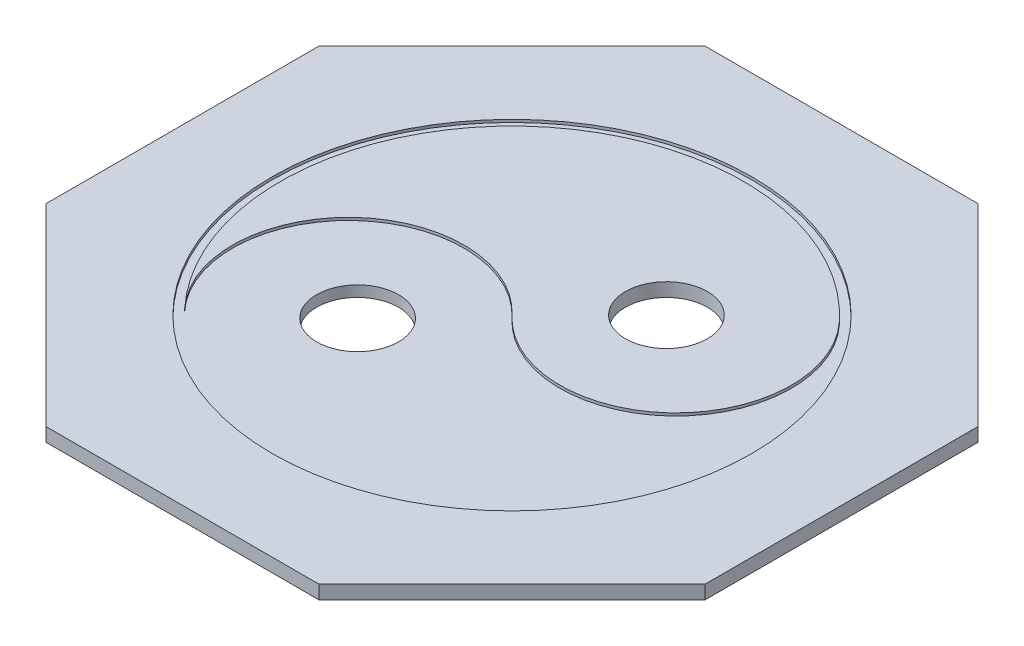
ISO-10303-21;
HEADER;
FILE_DESCRIPTION(('STEP AP214'),'2;1');
FILE_NAME('part.step','',(''),(''),'','','');
FILE_SCHEMA(('AUTOMOTIVE_DESIGN { 1 0 10303 214 1 1 1 1 }'));
ENDSEC;
DATA;
#1=APPLICATION_CONTEXT('core data for automotive mechanical design processes');
#2=APPLICATION_PROTOCOL_DEFINITION('international standard','automotive_design',2000,#1);
#3=PRODUCT_CONTEXT('',#1,'mechanical');
#4=PRODUCT('Part','Part','',(#3));
#5=PRODUCT_RELATED_PRODUCT_CATEGORY('part','',(#4));
#6=PRODUCT_DEFINITION_FORMATION('','',#4);
#7=PRODUCT_DEFINITION_CONTEXT('part definition',#1,'design');
#8=PRODUCT_DEFINITION('design','',#6,#7);
#9=PRODUCT_DEFINITION_SHAPE('','',#8);
#10=(LENGTH_UNIT() NAMED_UNIT(*) SI_UNIT(.MILLI.,.METRE.));
#11=(NAMED_UNIT(*) PLANE_ANGLE_UNIT() SI_UNIT($,.RADIAN.));
#12=(NAMED_UNIT(*) SI_UNIT($,.STERADIAN.) SOLID_ANGLE_UNIT());
#13=UNCERTAINTY_MEASURE_WITH_UNIT(LENGTH_MEASURE(1.E-05),#10,'distance_accuracy_value','');
#14=(GEOMETRIC_REPRESENTATION_CONTEXT(3) GLOBAL_UNCERTAINTY_ASSIGNED_CONTEXT((#13)) GLOBAL_UNIT_ASSIGNED_CONTEXT((#10,
#11,#12)) REPRESENTATION_CONTEXT('',''));
#15=CARTESIAN_POINT('',(0.,0.,0.));
#16=DIRECTION('',(0.,0.,1.));
#17=DIRECTION('',(1.,0.,0.));
#18=AXIS2_PLACEMENT_3D('',#15,#16,#17);
#19=CARTESIAN_POINT('',(0.,5.,0.));
#20=DIRECTION('',(0.,1.,0.));
#21=DIRECTION('',(0.,0.,1.));
#22=AXIS2_PLACEMENT_3D('',#19,#20,#21);
#23=PLANE('',#22);
#24=CARTESIAN_POINT('',(79.8894141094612,5.,-64.61542800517));
#25=DIRECTION('',(0.,1.,0.));
#26=DIRECTION('',(0.,0.,-1.));
#27=AXIS2_PLACEMENT_3D('',#24,#25,#26);
#28=CIRCLE('',#27,15.);
#29=CARTESIAN_POINT('',(79.8894141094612,5.,-79.61542800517));
#30=VERTEX_POINT('',#29);
#31=EDGE_CURVE('E193',#30,#30,#28,.T.);
#32=ORIENTED_EDGE('',*,*,#31,.F.);
#33=EDGE_LOOP('',(#32));
#34=FACE_BOUND('',#33,.T.);
#35=CARTESIAN_POINT('',(20.5913084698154,5.,-7.38349896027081));
#36=DIRECTION('',(0.,1.,0.));
#37=DIRECTION('',(0.,0.,1.));
#38=AXIS2_PLACEMENT_3D('',#35,#36,#37);
#39=CIRCLE('',#38,42.4243422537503);
#40=CARTESIAN_POINT('',(51.6051428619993,5.,-36.3311567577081));
#41=VERTEX_POINT('',#40);
#42=CARTESIAN_POINT('',(-10.4225259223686,5.,21.5641588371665));
#43=VERTEX_POINT('',#42);
#44=EDGE_CURVE('E214',#41,#43,#39,.T.);
#45=ORIENTED_EDGE('',*,*,#44,.F.);
#46=CARTESIAN_POINT('',(82.6189772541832,5.,-65.2788145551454));
#47=DIRECTION('',(0.,1.,0.));
#48=DIRECTION('',(0.,0.,1.));
#49=AXIS2_PLACEMENT_3D('',#46,#47,#48);
#50=CIRCLE('',#49,42.4243422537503);
#51=CARTESIAN_POINT('',(113.632811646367,5.,-94.2264723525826));
#52=VERTEX_POINT('',#51);
#53=EDGE_CURVE('E47',#41,#52,#50,.T.);
#54=ORIENTED_EDGE('',*,*,#53,.T.);
#55=CARTESIAN_POINT('',(51.6051428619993,5.,-36.3311567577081));
#56=DIRECTION('',(0.,1.,0.));
#57=DIRECTION('',(0.,0.,1.));
#58=AXIS2_PLACEMENT_3D('',#55,#56,#57);
#59=CIRCLE('',#58,84.8486845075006);
#60=EDGE_CURVE('E211',#52,#43,#59,.T.);
#61=ORIENTED_EDGE('',*,*,#60,.T.);
#62=EDGE_LOOP('',(#45,#54,#61));
#63=FACE_BOUND('',#62,.T.);
#64=ADVANCED_FACE('F32',(#34,#63),#23,.T.);
#65=CARTESIAN_POINT('',(23.3208716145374,5.,-8.04688551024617));
#66=DIRECTION('',(0.,-1.,0.));
#67=DIRECTION('',(0.,0.,-1.));
#68=AXIS2_PLACEMENT_3D('',#65,#66,#67);
#69=CYLINDRICAL_SURFACE('',#68,15.);
#70=CARTESIAN_POINT('',(23.3208716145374,0.,-8.04688551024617));
#71=DIRECTION('',(0.,1.,0.));
#72=DIRECTION('',(0.,0.,1.));
#73=AXIS2_PLACEMENT_3D('',#70,#71,#72);
#74=CIRCLE('',#73,15.);
#75=CARTESIAN_POINT('',(23.3208716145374,0.,6.95311448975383));
#76=VERTEX_POINT('',#75);
#77=EDGE_CURVE('E145',#76,#76,#74,.T.);
#78=ORIENTED_EDGE('',*,*,#77,.F.);
#79=EDGE_LOOP('',(#78));
#80=FACE_BOUND('',#79,.T.);
#81=CARTESIAN_POINT('',(23.3208716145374,4.,-8.04688551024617));
#82=DIRECTION('',(0.,1.,0.));
#83=DIRECTION('',(0.,0.,1.));
#84=AXIS2_PLACEMENT_3D('',#81,#82,#83);
#85=CIRCLE('',#84,15.);
#86=CARTESIAN_POINT('',(23.3208716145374,4.,6.95311448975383));
#87=VERTEX_POINT('',#86);
#88=EDGE_CURVE('E220',#87,#87,#85,.F.);
#89=ORIENTED_EDGE('',*,*,#88,.F.);
#90=EDGE_LOOP('',(#89));
#91=FACE_BOUND('',#90,.T.);
#92=ADVANCED_FACE('F265',(#80,#91),#69,.F.);
#93=CARTESIAN_POINT('',(51.6051428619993,5.,-36.3311567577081));
#94=DIRECTION('',(0.,1.,0.));
#95=DIRECTION('',(0.,0.,1.));
#96=AXIS2_PLACEMENT_3D('',#93,#94,#95);
#97=CIRCLE('',#96,87.8486845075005);
#98=CARTESIAN_POINT('',(51.6051428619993,5.,51.5175277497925));
#99=VERTEX_POINT('',#98);
#100=EDGE_CURVE('E207',#99,#99,#97,.T.);
#101=ORIENTED_EDGE('',*,*,#100,.F.);
#102=EDGE_LOOP('',(#101));
#103=FACE_BOUND('',#102,.T.);
#104=DIRECTION('',(0.707106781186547,0.,0.707106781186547));
#105=VECTOR('',#104,1.);
#106=CARTESIAN_POINT('',(-69.1055352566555,5.,13.6688432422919));
#107=LINE('',#106,#105);
#108=CARTESIAN_POINT('',(-69.1055352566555,5.,13.6688432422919));
#109=VERTEX_POINT('',#108);
#110=CARTESIAN_POINT('',(1.60514286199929,5.,84.3795213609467));
#111=VERTEX_POINT('',#110);
#112=EDGE_CURVE('E157',#109,#111,#107,.T.);
#113=ORIENTED_EDGE('',*,*,#112,.T.);
#114=DIRECTION('',(1.,0.,0.));
#115=VECTOR('',#114,1.);
#116=CARTESIAN_POINT('',(1.60514286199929,5.,84.3795213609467));
#117=LINE('',#116,#115);
#118=CARTESIAN_POINT('',(101.605142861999,5.,84.3795213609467));
#119=VERTEX_POINT('',#118);
#120=EDGE_CURVE('E97',#111,#119,#117,.T.);
#121=ORIENTED_EDGE('',*,*,#120,.T.);
#122=DIRECTION('',(0.707106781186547,0.,-0.707106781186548));
#123=VECTOR('',#122,1.);
#124=CARTESIAN_POINT('',(101.605142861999,5.,84.3795213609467));
#125=LINE('',#124,#123);
#126=CARTESIAN_POINT('',(172.315820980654,5.,13.6688432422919));
#127=VERTEX_POINT('',#126);
#128=EDGE_CURVE('E172',#119,#127,#125,.T.);
#129=ORIENTED_EDGE('',*,*,#128,.T.);
#130=DIRECTION('',(0.,0.,-1.));
#131=VECTOR('',#130,1.);
#132=CARTESIAN_POINT('',(172.315820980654,5.,13.6688432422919));
#133=LINE('',#132,#131);
#134=CARTESIAN_POINT('',(172.315820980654,5.,-86.3311567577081));
#135=VERTEX_POINT('',#134);
#136=EDGE_CURVE('E185',#127,#135,#133,.T.);
#137=ORIENTED_EDGE('',*,*,#136,.T.);
#138=DIRECTION('',(-0.707106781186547,0.,-0.707106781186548));
#139=VECTOR('',#138,1.);
#140=CARTESIAN_POINT('',(172.315820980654,5.,-86.3311567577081));
#141=LINE('',#140,#139);
#142=CARTESIAN_POINT('',(101.605142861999,5.,-157.041834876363));
#143=VERTEX_POINT('',#142);
#144=EDGE_CURVE('E120',#135,#143,#141,.T.);
#145=ORIENTED_EDGE('',*,*,#144,.T.);
#146=DIRECTION('',(-1.,0.,0.));
#147=VECTOR('',#146,1.);
#148=CARTESIAN_POINT('',(101.605142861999,5.,-157.041834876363));
#149=LINE('',#148,#147);
#150=CARTESIAN_POINT('',(1.60514286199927,5.,-157.041834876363));
#151=VERTEX_POINT('',#150);
#152=EDGE_CURVE('E113',#143,#151,#149,.T.);
#153=ORIENTED_EDGE('',*,*,#152,.T.);
#154=DIRECTION('',(-0.707106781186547,0.,0.707106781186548));
#155=VECTOR('',#154,1.);
#156=CARTESIAN_POINT('',(1.60514286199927,5.,-157.041834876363));
#157=LINE('',#156,#155);
#158=CARTESIAN_POINT('',(-69.1055352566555,5.,-86.3311567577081));
#159=VERTEX_POINT('',#158);
#160=EDGE_CURVE('E117',#151,#159,#157,.T.);
#161=ORIENTED_EDGE('',*,*,#160,.T.);
#162=DIRECTION('',(0.,0.,1.));
#163=VECTOR('',#162,1.);
#164=CARTESIAN_POINT('',(-69.1055352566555,5.,-86.3311567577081));
#165=LINE('',#164,#163);
#166=EDGE_CURVE('E56',#159,#109,#165,.T.);
#167=ORIENTED_EDGE('',*,*,#166,.T.);
#168=EDGE_LOOP('',(#113,#121,#129,#137,#145,#153,#161,#167));
#169=FACE_BOUND('',#168,.T.);
#170=ADVANCED_FACE('F115',(#103,#169),#23,.T.);
#171=CARTESIAN_POINT('',(0.,0.,0.));
#172=DIRECTION('',(0.,1.,0.));
#173=DIRECTION('',(0.,0.,1.));
#174=AXIS2_PLACEMENT_3D('',#171,#172,#173);
#175=PLANE('',#174);
#176=DIRECTION('',(0.707106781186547,0.,0.707106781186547));
#177=VECTOR('',#176,1.);
#178=CARTESIAN_POINT('',(-69.1055352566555,0.,13.6688432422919));
#179=LINE('',#178,#177);
#180=CARTESIAN_POINT('',(-69.1055352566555,0.,13.6688432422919));
#181=VERTEX_POINT('',#180);
#182=CARTESIAN_POINT('',(1.60514286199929,0.,84.3795213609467));
#183=VERTEX_POINT('',#182);
#184=EDGE_CURVE('E141',#181,#183,#179,.T.);
#185=ORIENTED_EDGE('',*,*,#184,.F.);
#186=DIRECTION('',(0.,0.,1.));
#187=VECTOR('',#186,1.);
#188=CARTESIAN_POINT('',(-69.1055352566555,0.,-86.3311567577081));
#189=LINE('',#188,#187);
#190=CARTESIAN_POINT('',(-69.1055352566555,0.,-86.3311567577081));
#191=VERTEX_POINT('',#190);
#192=EDGE_CURVE('E89',#191,#181,#189,.T.);
#193=ORIENTED_EDGE('',*,*,#192,.F.);
#194=DIRECTION('',(-0.707106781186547,0.,0.707106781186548));
#195=VECTOR('',#194,1.);
#196=CARTESIAN_POINT('',(1.60514286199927,0.,-157.041834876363));
#197=LINE('',#196,#195);
#198=CARTESIAN_POINT('',(1.60514286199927,0.,-157.041834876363));
#199=VERTEX_POINT('',#198);
#200=EDGE_CURVE('E154',#199,#191,#197,.T.);
#201=ORIENTED_EDGE('',*,*,#200,.F.);
#202=DIRECTION('',(-1.,0.,0.));
#203=VECTOR('',#202,1.);
#204=CARTESIAN_POINT('',(101.605142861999,0.,-157.041834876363));
#205=LINE('',#204,#203);
#206=CARTESIAN_POINT('',(101.605142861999,0.,-157.041834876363));
#207=VERTEX_POINT('',#206);
#208=EDGE_CURVE('E129',#207,#199,#205,.T.);
#209=ORIENTED_EDGE('',*,*,#208,.F.);
#210=DIRECTION('',(-0.707106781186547,0.,-0.707106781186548));
#211=VECTOR('',#210,1.);
#212=CARTESIAN_POINT('',(172.315820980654,0.,-86.3311567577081));
#213=LINE('',#212,#211);
#214=CARTESIAN_POINT('',(172.315820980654,0.,-86.3311567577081));
#215=VERTEX_POINT('',#214);
#216=EDGE_CURVE('E151',#215,#207,#213,.T.);
#217=ORIENTED_EDGE('',*,*,#216,.F.);
#218=DIRECTION('',(0.,0.,-1.));
#219=VECTOR('',#218,1.);
#220=CARTESIAN_POINT('',(172.315820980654,0.,13.6688432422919));
#221=LINE('',#220,#219);
#222=CARTESIAN_POINT('',(172.315820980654,0.,13.6688432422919));
#223=VERTEX_POINT('',#222);
#224=EDGE_CURVE('E149',#223,#215,#221,.T.);
#225=ORIENTED_EDGE('',*,*,#224,.F.);
#226=DIRECTION('',(0.707106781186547,0.,-0.707106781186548));
#227=VECTOR('',#226,1.);
#228=CARTESIAN_POINT('',(101.605142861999,0.,84.3795213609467));
#229=LINE('',#228,#227);
#230=CARTESIAN_POINT('',(101.605142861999,0.,84.3795213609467));
#231=VERTEX_POINT('',#230);
#232=EDGE_CURVE('E147',#231,#223,#229,.T.);
#233=ORIENTED_EDGE('',*,*,#232,.F.);
#234=DIRECTION('',(1.,0.,0.));
#235=VECTOR('',#234,1.);
#236=CARTESIAN_POINT('',(1.60514286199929,0.,84.3795213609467));
#237=LINE('',#236,#235);
#238=EDGE_CURVE('E144',#183,#231,#237,.T.);
#239=ORIENTED_EDGE('',*,*,#238,.F.);
#240=EDGE_LOOP('',(#185,#193,#201,#209,#217,#225,#233,#239));
#241=FACE_BOUND('',#240,.T.);
#242=ORIENTED_EDGE('',*,*,#77,.T.);
#243=EDGE_LOOP('',(#242));
#244=FACE_BOUND('',#243,.T.);
#245=CARTESIAN_POINT('',(79.8894141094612,0.,-64.61542800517));
#246=DIRECTION('',(0.,1.,0.));
#247=DIRECTION('',(0.,0.,-1.));
#248=AXIS2_PLACEMENT_3D('',#245,#246,#247);
#249=CIRCLE('',#248,15.);
#250=CARTESIAN_POINT('',(79.8894141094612,0.,-79.61542800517));
#251=VERTEX_POINT('',#250);
#252=EDGE_CURVE('E194',#251,#251,#249,.T.);
#253=ORIENTED_EDGE('',*,*,#252,.T.);
#254=EDGE_LOOP('',(#253));
#255=FACE_BOUND('',#254,.T.);
#256=ADVANCED_FACE('F176',(#241,#244,#255),#175,.F.);
#257=CARTESIAN_POINT('',(-69.1055352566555,5.,13.6688432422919));
#258=DIRECTION('',(0.707106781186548,0.,-0.707106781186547));
#259=DIRECTION('',(-0.707106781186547,0.,-0.707106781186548));
#260=AXIS2_PLACEMENT_3D('',#257,#258,#259);
#261=PLANE('',#260);
#262=ORIENTED_EDGE('',*,*,#184,.T.);
#263=DIRECTION('',(0.,-1.,0.));
#264=VECTOR('',#263,1.);
#265=CARTESIAN_POINT('',(1.60514286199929,5.,84.3795213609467));
#266=LINE('',#265,#264);
#267=EDGE_CURVE('E11',#111,#183,#266,.T.);
#268=ORIENTED_EDGE('',*,*,#267,.F.);
#269=ORIENTED_EDGE('',*,*,#112,.F.);
#270=DIRECTION('',(0.,-1.,0.));
#271=VECTOR('',#270,1.);
#272=CARTESIAN_POINT('',(-69.1055352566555,5.,13.6688432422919));
#273=LINE('',#272,#271);
#274=EDGE_CURVE('E137',#109,#181,#273,.T.);
#275=ORIENTED_EDGE('',*,*,#274,.T.);
#276=EDGE_LOOP('',(#262,#268,#269,#275));
#277=FACE_BOUND('',#276,.T.);
#278=ADVANCED_FACE('F34',(#277),#261,.F.);
#279=CARTESIAN_POINT('',(1.60514286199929,5.,84.3795213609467));
#280=DIRECTION('',(0.,0.,-1.));
#281=DIRECTION('',(-1.,0.,0.));
#282=AXIS2_PLACEMENT_3D('',#279,#280,#281);
#283=PLANE('',#282);
#284=ORIENTED_EDGE('',*,*,#238,.T.);
#285=DIRECTION('',(0.,-1.,0.));
#286=VECTOR('',#285,1.);
#287=CARTESIAN_POINT('',(101.605142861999,5.,84.3795213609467));
#288=LINE('',#287,#286);
#289=EDGE_CURVE('E40',#119,#231,#288,.T.);
#290=ORIENTED_EDGE('',*,*,#289,.F.);
#291=ORIENTED_EDGE('',*,*,#120,.F.);
#292=ORIENTED_EDGE('',*,*,#267,.T.);
#293=EDGE_LOOP('',(#284,#290,#291,#292));
#294=FACE_BOUND('',#293,.T.);
#295=ADVANCED_FACE('F379',(#294),#283,.F.);
#296=CARTESIAN_POINT('',(101.605142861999,5.,84.3795213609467));
#297=DIRECTION('',(-0.707106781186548,0.,-0.707106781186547));
#298=DIRECTION('',(-0.707106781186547,0.,0.707106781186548));
#299=AXIS2_PLACEMENT_3D('',#296,#297,#298);
#300=PLANE('',#299);
#301=ORIENTED_EDGE('',*,*,#232,.T.);
#302=DIRECTION('',(0.,-1.,0.));
#303=VECTOR('',#302,1.);
#304=CARTESIAN_POINT('',(172.315820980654,5.,13.6688432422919));
#305=LINE('',#304,#303);
#306=EDGE_CURVE('E164',#127,#223,#305,.T.);
#307=ORIENTED_EDGE('',*,*,#306,.F.);
#308=ORIENTED_EDGE('',*,*,#128,.F.);
#309=ORIENTED_EDGE('',*,*,#289,.T.);
#310=EDGE_LOOP('',(#301,#307,#308,#309));
#311=FACE_BOUND('',#310,.T.);
#312=ADVANCED_FACE('F170',(#311),#300,.F.);
#313=CARTESIAN_POINT('',(172.315820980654,5.,13.6688432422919));
#314=DIRECTION('',(-1.,0.,0.));
#315=DIRECTION('',(0.,0.,1.));
#316=AXIS2_PLACEMENT_3D('',#313,#314,#315);
#317=PLANE('',#316);
#318=ORIENTED_EDGE('',*,*,#224,.T.);
#319=DIRECTION('',(0.,-1.,0.));
#320=VECTOR('',#319,1.);
#321=CARTESIAN_POINT('',(172.315820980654,5.,-86.3311567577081));
#322=LINE('',#321,#320);
#323=EDGE_CURVE('E161',#135,#215,#322,.T.);
#324=ORIENTED_EDGE('',*,*,#323,.F.);
#325=ORIENTED_EDGE('',*,*,#136,.F.);
#326=ORIENTED_EDGE('',*,*,#306,.T.);
#327=EDGE_LOOP('',(#318,#324,#325,#326));
#328=FACE_BOUND('',#327,.T.);
#329=ADVANCED_FACE('F181',(#328),#317,.F.);
#330=CARTESIAN_POINT('',(172.315820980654,5.,-86.3311567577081));
#331=DIRECTION('',(-0.707106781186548,0.,0.707106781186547));
#332=DIRECTION('',(0.707106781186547,0.,0.707106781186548));
#333=AXIS2_PLACEMENT_3D('',#330,#331,#332);
#334=PLANE('',#333);
#335=ORIENTED_EDGE('',*,*,#216,.T.);
#336=DIRECTION('',(0.,-1.,0.));
#337=VECTOR('',#336,1.);
#338=CARTESIAN_POINT('',(101.605142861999,5.,-157.041834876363));
#339=LINE('',#338,#337);
#340=EDGE_CURVE('E132',#143,#207,#339,.T.);
#341=ORIENTED_EDGE('',*,*,#340,.F.);
#342=ORIENTED_EDGE('',*,*,#144,.F.);
#343=ORIENTED_EDGE('',*,*,#323,.T.);
#344=EDGE_LOOP('',(#335,#341,#342,#343));
#345=FACE_BOUND('',#344,.T.);
#346=ADVANCED_FACE('F184',(#345),#334,.F.);
#347=CARTESIAN_POINT('',(101.605142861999,5.,-157.041834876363));
#348=DIRECTION('',(0.,0.,1.));
#349=DIRECTION('',(1.,0.,0.));
#350=AXIS2_PLACEMENT_3D('',#347,#348,#349);
#351=PLANE('',#350);
#352=ORIENTED_EDGE('',*,*,#208,.T.);
#353=DIRECTION('',(0.,-1.,0.));
#354=VECTOR('',#353,1.);
#355=CARTESIAN_POINT('',(1.60514286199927,5.,-157.041834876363));
#356=LINE('',#355,#354);
#357=EDGE_CURVE('E126',#151,#199,#356,.T.);
#358=ORIENTED_EDGE('',*,*,#357,.F.);
#359=ORIENTED_EDGE('',*,*,#152,.F.);
#360=ORIENTED_EDGE('',*,*,#340,.T.);
#361=EDGE_LOOP('',(#352,#358,#359,#360));
#362=FACE_BOUND('',#361,.T.);
#363=ADVANCED_FACE('F127',(#362),#351,.F.);
#364=CARTESIAN_POINT('',(1.60514286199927,5.,-157.041834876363));
#365=DIRECTION('',(0.707106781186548,0.,0.707106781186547));
#366=DIRECTION('',(0.707106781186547,0.,-0.707106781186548));
#367=AXIS2_PLACEMENT_3D('',#364,#365,#366);
#368=PLANE('',#367);
#369=ORIENTED_EDGE('',*,*,#200,.T.);
#370=DIRECTION('',(0.,-1.,0.));
#371=VECTOR('',#370,1.);
#372=CARTESIAN_POINT('',(-69.1055352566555,5.,-86.3311567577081));
#373=LINE('',#372,#371);
#374=EDGE_CURVE('E133',#159,#191,#373,.T.);
#375=ORIENTED_EDGE('',*,*,#374,.F.);
#376=ORIENTED_EDGE('',*,*,#160,.F.);
#377=ORIENTED_EDGE('',*,*,#357,.T.);
#378=EDGE_LOOP('',(#369,#375,#376,#377));
#379=FACE_BOUND('',#378,.T.);
#380=ADVANCED_FACE('F135',(#379),#368,.F.);
#381=CARTESIAN_POINT('',(-69.1055352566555,5.,-86.3311567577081));
#382=DIRECTION('',(1.,0.,0.));
#383=DIRECTION('',(0.,0.,-1.));
#384=AXIS2_PLACEMENT_3D('',#381,#382,#383);
#385=PLANE('',#384);
#386=ORIENTED_EDGE('',*,*,#192,.T.);
#387=ORIENTED_EDGE('',*,*,#274,.F.);
#388=ORIENTED_EDGE('',*,*,#166,.F.);
#389=ORIENTED_EDGE('',*,*,#374,.T.);
#390=EDGE_LOOP('',(#386,#387,#388,#389));
#391=FACE_BOUND('',#390,.T.);
#392=ADVANCED_FACE('F283',(#391),#385,.F.);
#393=CARTESIAN_POINT('',(79.8894141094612,5.,-64.61542800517));
#394=DIRECTION('',(0.,-1.,0.));
#395=DIRECTION('',(0.,0.,-1.));
#396=AXIS2_PLACEMENT_3D('',#393,#394,#395);
#397=CYLINDRICAL_SURFACE('',#396,15.);
#398=ORIENTED_EDGE('',*,*,#31,.T.);
#399=EDGE_LOOP('',(#398));
#400=FACE_BOUND('',#399,.T.);
#401=ORIENTED_EDGE('',*,*,#252,.F.);
#402=EDGE_LOOP('',(#401));
#403=FACE_BOUND('',#402,.T.);
#404=ADVANCED_FACE('F280',(#400,#403),#397,.F.);
#405=CARTESIAN_POINT('',(82.6189772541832,4.,-65.2788145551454));
#406=DIRECTION('',(0.,1.,0.));
#407=DIRECTION('',(0.,0.,1.));
#408=AXIS2_PLACEMENT_3D('',#405,#406,#407);
#409=CYLINDRICAL_SURFACE('',#408,42.4243422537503);
#410=ORIENTED_EDGE('',*,*,#53,.F.);
#411=DIRECTION('',(0.,1.,0.));
#412=VECTOR('',#411,1.);
#413=CARTESIAN_POINT('',(51.6051428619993,4.,-36.3311567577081));
#414=LINE('',#413,#412);
#415=CARTESIAN_POINT('',(51.6051428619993,4.,-36.3311567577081));
#416=VERTEX_POINT('',#415);
#417=EDGE_CURVE('E200',#416,#41,#414,.T.);
#418=ORIENTED_EDGE('',*,*,#417,.F.);
#419=CARTESIAN_POINT('',(82.6189772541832,4.,-65.2788145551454));
#420=DIRECTION('',(0.,1.,0.));
#421=DIRECTION('',(0.,0.,1.));
#422=AXIS2_PLACEMENT_3D('',#419,#420,#421);
#423=CIRCLE('',#422,42.4243422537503);
#424=CARTESIAN_POINT('',(113.632811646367,4.,-94.2264723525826));
#425=VERTEX_POINT('',#424);
#426=EDGE_CURVE('E210',#416,#425,#423,.T.);
#427=ORIENTED_EDGE('',*,*,#426,.T.);
#428=DIRECTION('',(0.,1.,0.));
#429=VECTOR('',#428,1.);
#430=CARTESIAN_POINT('',(113.632811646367,4.,-94.2264723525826));
#431=LINE('',#430,#429);
#432=EDGE_CURVE('E197',#425,#52,#431,.T.);
#433=ORIENTED_EDGE('',*,*,#432,.T.);
#434=EDGE_LOOP('',(#410,#418,#427,#433));
#435=FACE_BOUND('',#434,.T.);
#436=ADVANCED_FACE('F232',(#435),#409,.T.);
#437=CARTESIAN_POINT('',(51.6051428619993,4.,-36.3311567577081));
#438=DIRECTION('',(0.,1.,0.));
#439=DIRECTION('',(0.,0.,1.));
#440=AXIS2_PLACEMENT_3D('',#437,#438,#439);
#441=CYLINDRICAL_SURFACE('',#440,84.8486845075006);
#442=ORIENTED_EDGE('',*,*,#60,.F.);
#443=ORIENTED_EDGE('',*,*,#432,.F.);
#444=CARTESIAN_POINT('',(51.6051428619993,4.,-36.3311567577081));
#445=DIRECTION('',(0.,1.,0.));
#446=DIRECTION('',(0.,0.,1.));
#447=AXIS2_PLACEMENT_3D('',#444,#445,#446);
#448=CIRCLE('',#447,84.8486845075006);
#449=CARTESIAN_POINT('',(-10.4225259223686,4.,21.5641588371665));
#450=VERTEX_POINT('',#449);
#451=EDGE_CURVE('E223',#425,#450,#448,.T.);
#452=ORIENTED_EDGE('',*,*,#451,.T.);
#453=DIRECTION('',(0.,1.,0.));
#454=VECTOR('',#453,1.);
#455=CARTESIAN_POINT('',(-10.4225259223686,4.,21.5641588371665));
#456=LINE('',#455,#454);
#457=EDGE_CURVE('E202',#450,#43,#456,.T.);
#458=ORIENTED_EDGE('',*,*,#457,.T.);
#459=EDGE_LOOP('',(#442,#443,#452,#458));
#460=FACE_BOUND('',#459,.T.);
#461=ADVANCED_FACE('F241',(#460),#441,.T.);
#462=CARTESIAN_POINT('',(20.5913084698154,4.,-7.38349896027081));
#463=DIRECTION('',(0.,1.,0.));
#464=DIRECTION('',(0.,0.,1.));
#465=AXIS2_PLACEMENT_3D('',#462,#463,#464);
#466=CYLINDRICAL_SURFACE('',#465,42.4243422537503);
#467=ORIENTED_EDGE('',*,*,#44,.T.);
#468=ORIENTED_EDGE('',*,*,#457,.F.);
#469=CARTESIAN_POINT('',(20.5913084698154,4.,-7.38349896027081));
#470=DIRECTION('',(0.,1.,0.));
#471=DIRECTION('',(0.,0.,1.));
#472=AXIS2_PLACEMENT_3D('',#469,#470,#471);
#473=CIRCLE('',#472,42.4243422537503);
#474=EDGE_CURVE('E226',#416,#450,#473,.T.);
#475=ORIENTED_EDGE('',*,*,#474,.F.);
#476=ORIENTED_EDGE('',*,*,#417,.T.);
#477=EDGE_LOOP('',(#467,#468,#475,#476));
#478=FACE_BOUND('',#477,.T.);
#479=ADVANCED_FACE('F249',(#478),#466,.F.);
#480=CARTESIAN_POINT('',(51.6051428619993,4.,-36.3311567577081));
#481=DIRECTION('',(0.,1.,0.));
#482=DIRECTION('',(0.,0.,1.));
#483=AXIS2_PLACEMENT_3D('',#480,#481,#482);
#484=CYLINDRICAL_SURFACE('',#483,87.8486845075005);
#485=CARTESIAN_POINT('',(51.6051428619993,4.,-36.3311567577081));
#486=DIRECTION('',(0.,1.,0.));
#487=DIRECTION('',(0.,0.,1.));
#488=AXIS2_PLACEMENT_3D('',#485,#486,#487);
#489=CIRCLE('',#488,87.8486845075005);
#490=CARTESIAN_POINT('',(51.6051428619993,4.,51.5175277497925));
#491=VERTEX_POINT('',#490);
#492=EDGE_CURVE('E203',#491,#491,#489,.T.);
#493=ORIENTED_EDGE('',*,*,#492,.F.);
#494=EDGE_LOOP('',(#493));
#495=FACE_BOUND('',#494,.T.);
#496=ORIENTED_EDGE('',*,*,#100,.T.);
#497=EDGE_LOOP('',(#496));
#498=FACE_BOUND('',#497,.T.);
#499=ADVANCED_FACE('F253',(#495,#498),#484,.F.);
#500=CARTESIAN_POINT('',(0.,4.,0.));
#501=DIRECTION('',(0.,1.,0.));
#502=DIRECTION('',(0.,0.,1.));
#503=AXIS2_PLACEMENT_3D('',#500,#501,#502);
#504=PLANE('',#503);
#505=ORIENTED_EDGE('',*,*,#426,.F.);
#506=ORIENTED_EDGE('',*,*,#474,.T.);
#507=ORIENTED_EDGE('',*,*,#451,.F.);
#508=EDGE_LOOP('',(#505,#506,#507));
#509=FACE_BOUND('',#508,.T.);
#510=ORIENTED_EDGE('',*,*,#88,.T.);
#511=EDGE_LOOP('',(#510));
#512=FACE_BOUND('',#511,.T.);
#513=ORIENTED_EDGE('',*,*,#492,.T.);
#514=EDGE_LOOP('',(#513));
#515=FACE_BOUND('',#514,.T.);
#516=ADVANCED_FACE('F250',(#509,#512,#515),#504,.T.);
#517=CLOSED_SHELL('',(#64,#92,#170,#256,#278,#295,#312,#329,#346,#363,#380,#392,#404,#436,#461,
#479,#499,#516));
#518=MANIFOLD_SOLID_BREP('B2',#517);
#519=ADVANCED_BREP_SHAPE_REPRESENTATION('',(#18,#518),#14);
#520=SHAPE_DEFINITION_REPRESENTATION(#9,#519);
ENDSEC;
END-ISO-10303-21;
